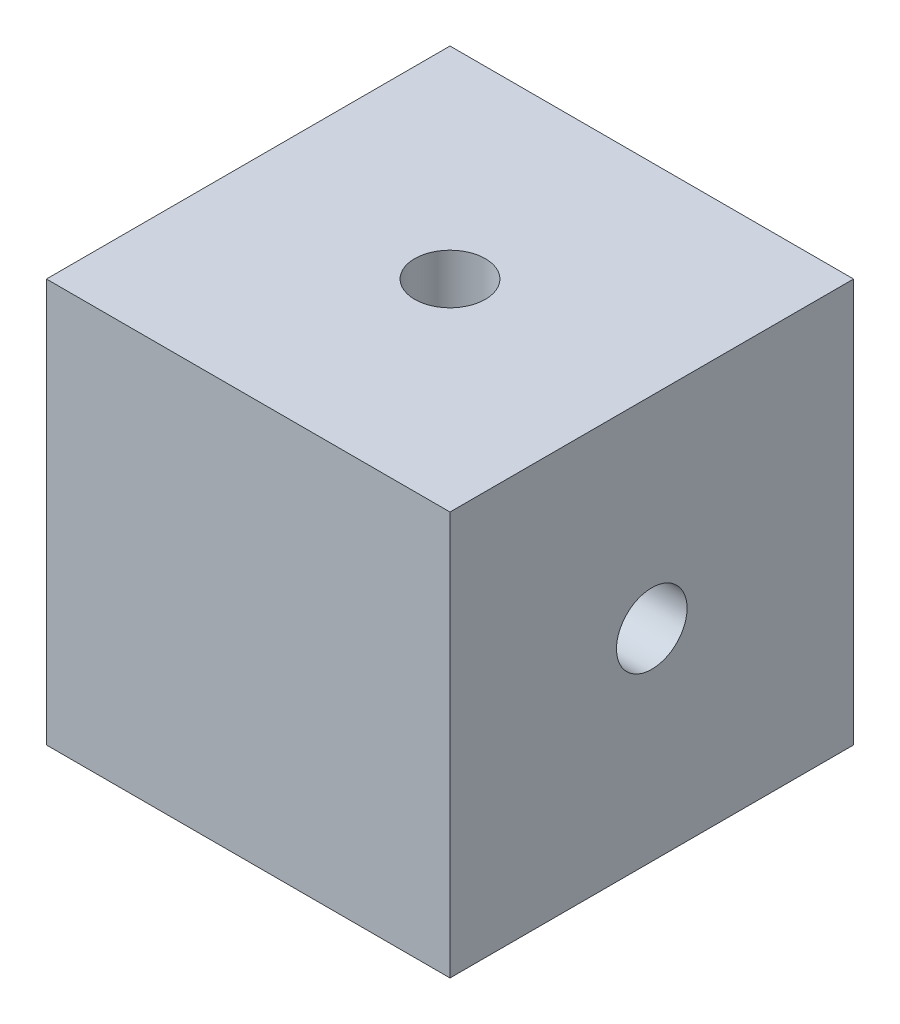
from build123d import *

# Parameters (mm, degrees)
SKETCH1_W      = 20
SKETCH1_H      = 20
SKETCH1_R      = 1.75
EXTRUDE1_DEPTH = 20
SKETCH2_R      = 1.75
EXTRUDE2_DEPTH = 35.641016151


with BuildPart() as part:
    # Sketch1 → Extrude1 (new body)
    with BuildSketch(Plane(origin=(0, 0, 0), x_dir=(1, 0, 0), z_dir=(0, 1, 0))):
        with Locations((10, 10)):
            Rectangle(SKETCH1_W, SKETCH1_H)
        with Locations(Location((10, 10, 0), (0, 0, 270))):
            Circle(SKETCH1_R, mode=Mode.SUBTRACT)
    extrude(amount=EXTRUDE1_DEPTH)

    # Sketch2 → Extrude2 (cut, through all)
    with BuildSketch(Plane(origin=(20, 0, 0), x_dir=(0, 0, -1), z_dir=(1, 0, 0))):
        with Locations((10, 10)):
            Circle(SKETCH2_R)
    extrude(amount=-EXTRUDE2_DEPTH, mode=Mode.SUBTRACT)


solid = part.part
